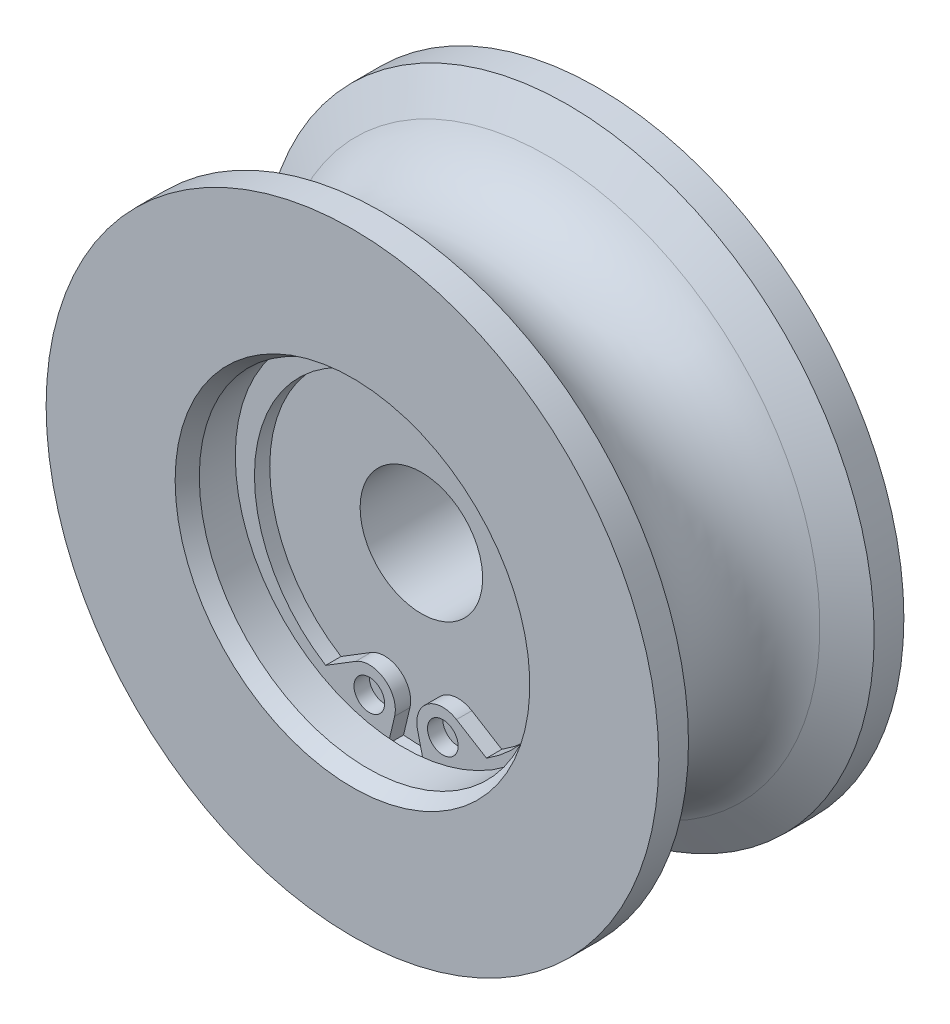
ISO-10303-21;
HEADER;
FILE_DESCRIPTION(('STEP AP214'),'2;1');
FILE_NAME('part.step','',(''),(''),'','','');
FILE_SCHEMA(('AUTOMOTIVE_DESIGN { 1 0 10303 214 1 1 1 1 }'));
ENDSEC;
DATA;
#1=APPLICATION_CONTEXT('core data for automotive mechanical design processes');
#2=APPLICATION_PROTOCOL_DEFINITION('international standard','automotive_design',2000,#1);
#3=PRODUCT_CONTEXT('',#1,'mechanical');
#4=PRODUCT('Part','Part','',(#3));
#5=PRODUCT_RELATED_PRODUCT_CATEGORY('part','',(#4));
#6=PRODUCT_DEFINITION_FORMATION('','',#4);
#7=PRODUCT_DEFINITION_CONTEXT('part definition',#1,'design');
#8=PRODUCT_DEFINITION('design','',#6,#7);
#9=PRODUCT_DEFINITION_SHAPE('','',#8);
#10=(LENGTH_UNIT() NAMED_UNIT(*) SI_UNIT(.MILLI.,.METRE.));
#11=(NAMED_UNIT(*) PLANE_ANGLE_UNIT() SI_UNIT($,.RADIAN.));
#12=(NAMED_UNIT(*) SI_UNIT($,.STERADIAN.) SOLID_ANGLE_UNIT());
#13=UNCERTAINTY_MEASURE_WITH_UNIT(LENGTH_MEASURE(1.E-05),#10,'distance_accuracy_value','');
#14=(GEOMETRIC_REPRESENTATION_CONTEXT(3) GLOBAL_UNCERTAINTY_ASSIGNED_CONTEXT((#13)) GLOBAL_UNIT_ASSIGNED_CONTEXT((#10,
#11,#12)) REPRESENTATION_CONTEXT('',''));
#15=CARTESIAN_POINT('',(0.,0.,0.));
#16=DIRECTION('',(0.,0.,1.));
#17=DIRECTION('',(1.,0.,0.));
#18=AXIS2_PLACEMENT_3D('',#15,#16,#17);
#19=CARTESIAN_POINT('',(0.,4.,3.5));
#20=DIRECTION('',(0.,0.,1.));
#21=DIRECTION('',(1.,0.,0.));
#22=AXIS2_PLACEMENT_3D('',#19,#20,#21);
#23=PLANE('',#22);
#24=CARTESIAN_POINT('',(2.4,-9.28614557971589,3.5));
#25=DIRECTION('',(0.,0.,1.));
#26=DIRECTION('',(1.,0.,0.));
#27=AXIS2_PLACEMENT_3D('',#24,#25,#26);
#28=CIRCLE('',#27,1.);
#29=CARTESIAN_POINT('',(3.4,-9.28614557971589,3.5));
#30=VERTEX_POINT('',#29);
#31=EDGE_CURVE('E571',#30,#30,#28,.T.);
#32=ORIENTED_EDGE('',*,*,#31,.T.);
#33=EDGE_LOOP('',(#32));
#34=FACE_BOUND('',#33,.T.);
#35=ADVANCED_FACE('F14',(#34),#23,.T.);
#36=CARTESIAN_POINT('',(-2.4,-9.28614557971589,3.5));
#37=DIRECTION('',(0.,0.,-1.));
#38=DIRECTION('',(1.,0.,0.));
#39=AXIS2_PLACEMENT_3D('',#36,#37,#38);
#40=CIRCLE('',#39,1.);
#41=CARTESIAN_POINT('',(-1.4,-9.28614557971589,3.5));
#42=VERTEX_POINT('',#41);
#43=EDGE_CURVE('E130',#42,#42,#40,.T.);
#44=ORIENTED_EDGE('',*,*,#43,.F.);
#45=EDGE_LOOP('',(#44));
#46=FACE_BOUND('',#45,.T.);
#47=ADVANCED_FACE('F204',(#46),#23,.T.);
#48=CARTESIAN_POINT('',(0.,0.,0.));
#49=DIRECTION('',(0.,0.,-1.));
#50=DIRECTION('',(-1.,0.,0.));
#51=AXIS2_PLACEMENT_3D('',#48,#49,#50);
#52=TOROIDAL_SURFACE('',#51,20.5,5.5);
#53=CARTESIAN_POINT('',(0.,0.,4.76313972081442));
#54=DIRECTION('',(0.,0.,-1.));
#55=DIRECTION('',(-1.,0.,0.));
#56=AXIS2_PLACEMENT_3D('',#53,#54,#55);
#57=CIRCLE('',#56,17.75);
#58=CARTESIAN_POINT('',(-17.75,0.,4.76313972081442));
#59=VERTEX_POINT('',#58);
#60=EDGE_CURVE('E176',#59,#59,#57,.T.);
#61=ORIENTED_EDGE('',*,*,#60,.T.);
#62=EDGE_LOOP('',(#61));
#63=FACE_BOUND('',#62,.T.);
#64=CARTESIAN_POINT('',(0.,0.,-4.76313972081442));
#65=DIRECTION('',(0.,0.,-1.));
#66=DIRECTION('',(-1.,0.,0.));
#67=AXIS2_PLACEMENT_3D('',#64,#65,#66);
#68=CIRCLE('',#67,17.75);
#69=CARTESIAN_POINT('',(-17.75,0.,-4.76313972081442));
#70=VERTEX_POINT('',#69);
#71=EDGE_CURVE('E179',#70,#70,#68,.T.);
#72=ORIENTED_EDGE('',*,*,#71,.F.);
#73=EDGE_LOOP('',(#72));
#74=FACE_BOUND('',#73,.T.);
#75=ADVANCED_FACE('F199',(#63,#74),#52,.F.);
#76=CARTESIAN_POINT('',(0.,0.,4.76313972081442));
#77=DIRECTION('',(0.,0.,1.));
#78=DIRECTION('',(1.,0.,0.));
#79=AXIS2_PLACEMENT_3D('',#76,#77,#78);
#80=CONICAL_SURFACE('',#79,17.75,1.0471975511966);
#81=CARTESIAN_POINT('',(0.,0.,6.06217782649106));
#82=DIRECTION('',(0.,0.,-1.));
#83=DIRECTION('',(-1.,0.,0.));
#84=AXIS2_PLACEMENT_3D('',#81,#82,#83);
#85=CIRCLE('',#84,20.);
#86=CARTESIAN_POINT('',(-20.,0.,6.06217782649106));
#87=VERTEX_POINT('',#86);
#88=EDGE_CURVE('E173',#87,#87,#85,.T.);
#89=ORIENTED_EDGE('',*,*,#88,.T.);
#90=EDGE_LOOP('',(#89));
#91=FACE_BOUND('',#90,.T.);
#92=ORIENTED_EDGE('',*,*,#60,.F.);
#93=EDGE_LOOP('',(#92));
#94=FACE_BOUND('',#93,.T.);
#95=ADVANCED_FACE('F190',(#91,#94),#80,.T.);
#96=CARTESIAN_POINT('',(0.,0.,-6.06217782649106));
#97=DIRECTION('',(0.,0.,-1.));
#98=DIRECTION('',(-1.,0.,0.));
#99=AXIS2_PLACEMENT_3D('',#96,#97,#98);
#100=CONICAL_SURFACE('',#99,20.,1.0471975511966);
#101=ORIENTED_EDGE('',*,*,#71,.T.);
#102=EDGE_LOOP('',(#101));
#103=FACE_BOUND('',#102,.T.);
#104=CARTESIAN_POINT('',(0.,0.,-6.06217782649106));
#105=DIRECTION('',(0.,0.,-1.));
#106=DIRECTION('',(-1.,0.,0.));
#107=AXIS2_PLACEMENT_3D('',#104,#105,#106);
#108=CIRCLE('',#107,20.);
#109=CARTESIAN_POINT('',(-20.,0.,-6.06217782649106));
#110=VERTEX_POINT('',#109);
#111=EDGE_CURVE('E131',#110,#110,#108,.T.);
#112=ORIENTED_EDGE('',*,*,#111,.F.);
#113=EDGE_LOOP('',(#112));
#114=FACE_BOUND('',#113,.T.);
#115=ADVANCED_FACE('F187',(#103,#114),#100,.T.);
#116=CARTESIAN_POINT('',(0.,0.,-8.));
#117=DIRECTION('',(0.,0.,-1.));
#118=DIRECTION('',(-1.,0.,0.));
#119=AXIS2_PLACEMENT_3D('',#116,#117,#118);
#120=CYLINDRICAL_SURFACE('',#119,20.);
#121=CARTESIAN_POINT('',(0.,0.,8.));
#122=DIRECTION('',(0.,0.,-1.));
#123=DIRECTION('',(-1.,0.,0.));
#124=AXIS2_PLACEMENT_3D('',#121,#122,#123);
#125=CIRCLE('',#124,20.);
#126=CARTESIAN_POINT('',(-20.,0.,8.));
#127=VERTEX_POINT('',#126);
#128=EDGE_CURVE('E170',#127,#127,#125,.T.);
#129=ORIENTED_EDGE('',*,*,#128,.T.);
#130=EDGE_LOOP('',(#129));
#131=FACE_BOUND('',#130,.T.);
#132=ORIENTED_EDGE('',*,*,#88,.F.);
#133=EDGE_LOOP('',(#132));
#134=FACE_BOUND('',#133,.T.);
#135=ADVANCED_FACE('F189',(#131,#134),#120,.T.);
#136=CARTESIAN_POINT('',(0.,0.,-8.));
#137=DIRECTION('',(0.,0.,-1.));
#138=DIRECTION('',(-1.,0.,0.));
#139=AXIS2_PLACEMENT_3D('',#136,#137,#138);
#140=CYLINDRICAL_SURFACE('',#139,20.);
#141=ORIENTED_EDGE('',*,*,#111,.T.);
#142=EDGE_LOOP('',(#141));
#143=FACE_BOUND('',#142,.T.);
#144=CARTESIAN_POINT('',(0.,0.,-8.));
#145=DIRECTION('',(0.,0.,-1.));
#146=DIRECTION('',(-1.,0.,0.));
#147=AXIS2_PLACEMENT_3D('',#144,#145,#146);
#148=CIRCLE('',#147,20.);
#149=CARTESIAN_POINT('',(-20.,0.,-8.));
#150=VERTEX_POINT('',#149);
#151=EDGE_CURVE('E142',#150,#150,#148,.T.);
#152=ORIENTED_EDGE('',*,*,#151,.F.);
#153=EDGE_LOOP('',(#152));
#154=FACE_BOUND('',#153,.T.);
#155=ADVANCED_FACE('F16',(#143,#154),#140,.T.);
#156=CARTESIAN_POINT('',(0.,20.,8.));
#157=DIRECTION('',(0.,0.,1.));
#158=DIRECTION('',(1.,0.,0.));
#159=AXIS2_PLACEMENT_3D('',#156,#157,#158);
#160=PLANE('',#159);
#161=CARTESIAN_POINT('',(0.,0.,8.));
#162=DIRECTION('',(0.,0.,-1.));
#163=DIRECTION('',(-1.,0.,0.));
#164=AXIS2_PLACEMENT_3D('',#161,#162,#163);
#165=CIRCLE('',#164,11.5773502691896);
#166=CARTESIAN_POINT('',(-11.5773502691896,0.,8.));
#167=VERTEX_POINT('',#166);
#168=EDGE_CURVE('E167',#167,#167,#165,.T.);
#169=ORIENTED_EDGE('',*,*,#168,.T.);
#170=EDGE_LOOP('',(#169));
#171=FACE_BOUND('',#170,.T.);
#172=ORIENTED_EDGE('',*,*,#128,.F.);
#173=EDGE_LOOP('',(#172));
#174=FACE_BOUND('',#173,.T.);
#175=ADVANCED_FACE('F260',(#171,#174),#160,.T.);
#176=CARTESIAN_POINT('',(0.,9.,-8.));
#177=DIRECTION('',(0.,0.,-1.));
#178=DIRECTION('',(-1.,0.,0.));
#179=AXIS2_PLACEMENT_3D('',#176,#177,#178);
#180=PLANE('',#179);
#181=ORIENTED_EDGE('',*,*,#151,.T.);
#182=EDGE_LOOP('',(#181));
#183=FACE_BOUND('',#182,.T.);
#184=CARTESIAN_POINT('',(0.,0.,-8.));
#185=DIRECTION('',(0.,0.,-1.));
#186=DIRECTION('',(-1.,0.,0.));
#187=AXIS2_PLACEMENT_3D('',#184,#185,#186);
#188=CIRCLE('',#187,9.);
#189=CARTESIAN_POINT('',(-9.,0.,-8.));
#190=VERTEX_POINT('',#189);
#191=EDGE_CURVE('E145',#190,#190,#188,.T.);
#192=ORIENTED_EDGE('',*,*,#191,.F.);
#193=EDGE_LOOP('',(#192));
#194=FACE_BOUND('',#193,.T.);
#195=ADVANCED_FACE('F256',(#183,#194),#180,.T.);
#196=CARTESIAN_POINT('',(0.,0.,8.));
#197=DIRECTION('',(0.,0.,1.));
#198=DIRECTION('',(1.,0.,0.));
#199=AXIS2_PLACEMENT_3D('',#196,#197,#198);
#200=CONICAL_SURFACE('',#199,11.5773502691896,0.523598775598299);
#201=CARTESIAN_POINT('',(0.,0.,7.));
#202=DIRECTION('',(0.,0.,-1.));
#203=DIRECTION('',(-1.,0.,0.));
#204=AXIS2_PLACEMENT_3D('',#201,#202,#203);
#205=CIRCLE('',#204,11.);
#206=CARTESIAN_POINT('',(-11.,0.,7.));
#207=VERTEX_POINT('',#206);
#208=EDGE_CURVE('E164',#207,#207,#205,.T.);
#209=ORIENTED_EDGE('',*,*,#208,.T.);
#210=EDGE_LOOP('',(#209));
#211=FACE_BOUND('',#210,.T.);
#212=ORIENTED_EDGE('',*,*,#168,.F.);
#213=EDGE_LOOP('',(#212));
#214=FACE_BOUND('',#213,.T.);
#215=ADVANCED_FACE('F259',(#211,#214),#200,.F.);
#216=CARTESIAN_POINT('',(0.,0.,-8.));
#217=DIRECTION('',(0.,0.,-1.));
#218=DIRECTION('',(-1.,0.,0.));
#219=AXIS2_PLACEMENT_3D('',#216,#217,#218);
#220=CYLINDRICAL_SURFACE('',#219,9.);
#221=ORIENTED_EDGE('',*,*,#191,.T.);
#222=EDGE_LOOP('',(#221));
#223=FACE_BOUND('',#222,.T.);
#224=CARTESIAN_POINT('',(0.,0.,-3.5));
#225=DIRECTION('',(0.,0.,-1.));
#226=DIRECTION('',(-1.,0.,0.));
#227=AXIS2_PLACEMENT_3D('',#224,#225,#226);
#228=CIRCLE('',#227,9.);
#229=CARTESIAN_POINT('',(-9.,0.,-3.5));
#230=VERTEX_POINT('',#229);
#231=EDGE_CURVE('E148',#230,#230,#228,.T.);
#232=ORIENTED_EDGE('',*,*,#231,.F.);
#233=EDGE_LOOP('',(#232));
#234=FACE_BOUND('',#233,.T.);
#235=ADVANCED_FACE('F262',(#223,#234),#220,.F.);
#236=CARTESIAN_POINT('',(0.,0.,-8.));
#237=DIRECTION('',(0.,0.,-1.));
#238=DIRECTION('',(-1.,0.,0.));
#239=AXIS2_PLACEMENT_3D('',#236,#237,#238);
#240=CYLINDRICAL_SURFACE('',#239,11.);
#241=CARTESIAN_POINT('',(0.,0.,4.65));
#242=DIRECTION('',(0.,0.,-1.));
#243=DIRECTION('',(-1.,0.,0.));
#244=AXIS2_PLACEMENT_3D('',#241,#242,#243);
#245=CIRCLE('',#244,11.);
#246=CARTESIAN_POINT('',(-11.,0.,4.65));
#247=VERTEX_POINT('',#246);
#248=EDGE_CURVE('E161',#247,#247,#245,.T.);
#249=ORIENTED_EDGE('',*,*,#248,.T.);
#250=EDGE_LOOP('',(#249));
#251=FACE_BOUND('',#250,.T.);
#252=ORIENTED_EDGE('',*,*,#208,.F.);
#253=EDGE_LOOP('',(#252));
#254=FACE_BOUND('',#253,.T.);
#255=ADVANCED_FACE('F265',(#251,#254),#240,.F.);
#256=CARTESIAN_POINT('',(0.,9.,-3.5));
#257=DIRECTION('',(0.,0.,-1.));
#258=DIRECTION('',(-1.,0.,0.));
#259=AXIS2_PLACEMENT_3D('',#256,#257,#258);
#260=PLANE('',#259);
#261=ORIENTED_EDGE('',*,*,#231,.T.);
#262=EDGE_LOOP('',(#261));
#263=FACE_BOUND('',#262,.T.);
#264=CARTESIAN_POINT('',(0.,0.,-3.5));
#265=DIRECTION('',(0.,0.,-1.));
#266=DIRECTION('',(-1.,0.,0.));
#267=AXIS2_PLACEMENT_3D('',#264,#265,#266);
#268=CIRCLE('',#267,4.);
#269=CARTESIAN_POINT('',(-4.,0.,-3.5));
#270=VERTEX_POINT('',#269);
#271=EDGE_CURVE('E151',#270,#270,#268,.T.);
#272=ORIENTED_EDGE('',*,*,#271,.F.);
#273=EDGE_LOOP('',(#272));
#274=FACE_BOUND('',#273,.T.);
#275=ADVANCED_FACE('F267',(#263,#274),#260,.T.);
#276=CARTESIAN_POINT('',(0.,11.5,4.65));
#277=DIRECTION('',(0.,0.,-1.));
#278=DIRECTION('',(-1.,0.,0.));
#279=AXIS2_PLACEMENT_3D('',#276,#277,#278);
#280=PLANE('',#279);
#281=CARTESIAN_POINT('',(0.,0.,4.65));
#282=DIRECTION('',(0.,0.,-1.));
#283=DIRECTION('',(-1.,0.,0.));
#284=AXIS2_PLACEMENT_3D('',#281,#282,#283);
#285=CIRCLE('',#284,11.5);
#286=CARTESIAN_POINT('',(-11.5,0.,4.65));
#287=VERTEX_POINT('',#286);
#288=EDGE_CURVE('E158',#287,#287,#285,.T.);
#289=ORIENTED_EDGE('',*,*,#288,.T.);
#290=EDGE_LOOP('',(#289));
#291=FACE_BOUND('',#290,.T.);
#292=ORIENTED_EDGE('',*,*,#248,.F.);
#293=EDGE_LOOP('',(#292));
#294=FACE_BOUND('',#293,.T.);
#295=ADVANCED_FACE('F269',(#291,#294),#280,.T.);
#296=CARTESIAN_POINT('',(0.,0.,-8.));
#297=DIRECTION('',(0.,0.,-1.));
#298=DIRECTION('',(-1.,0.,0.));
#299=AXIS2_PLACEMENT_3D('',#296,#297,#298);
#300=CYLINDRICAL_SURFACE('',#299,11.5);
#301=ORIENTED_EDGE('',*,*,#288,.F.);
#302=EDGE_LOOP('',(#301));
#303=FACE_BOUND('',#302,.T.);
#304=DIRECTION('',(0.,0.,-1.));
#305=VECTOR('',#304,1.);
#306=CARTESIAN_POINT('',(1.16498191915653,-11.440839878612,-8.));
#307=LINE('',#306,#305);
#308=CARTESIAN_POINT('',(1.16498191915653,-11.440839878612,3.5));
#309=VERTEX_POINT('',#308);
#310=CARTESIAN_POINT('',(1.16498191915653,-11.440839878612,4.5));
#311=VERTEX_POINT('',#310);
#312=EDGE_CURVE('E18',#309,#311,#307,.F.);
#313=ORIENTED_EDGE('',*,*,#312,.F.);
#314=CARTESIAN_POINT('',(0.,0.,3.5));
#315=DIRECTION('',(0.,0.,-1.));
#316=DIRECTION('',(-1.,0.,0.));
#317=AXIS2_PLACEMENT_3D('',#314,#315,#316);
#318=CIRCLE('',#317,11.5);
#319=CARTESIAN_POINT('',(-1.16498191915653,-11.440839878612,3.5));
#320=VERTEX_POINT('',#319);
#321=EDGE_CURVE('E107',#309,#320,#318,.T.);
#322=ORIENTED_EDGE('',*,*,#321,.T.);
#323=DIRECTION('',(0.,0.,-1.));
#324=VECTOR('',#323,1.);
#325=CARTESIAN_POINT('',(-1.16498191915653,-11.440839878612,-8.));
#326=LINE('',#325,#324);
#327=CARTESIAN_POINT('',(-1.16498191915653,-11.440839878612,4.5));
#328=VERTEX_POINT('',#327);
#329=EDGE_CURVE('E138',#328,#320,#326,.T.);
#330=ORIENTED_EDGE('',*,*,#329,.F.);
#331=CARTESIAN_POINT('',(0.,0.,4.5));
#332=DIRECTION('',(0.,0.,-1.));
#333=DIRECTION('',(-1.,0.,0.));
#334=AXIS2_PLACEMENT_3D('',#331,#332,#333);
#335=CIRCLE('',#334,11.5);
#336=EDGE_CURVE('E9',#311,#328,#335,.F.);
#337=ORIENTED_EDGE('',*,*,#336,.F.);
#338=EDGE_LOOP('',(#313,#322,#330,#337));
#339=FACE_BOUND('',#338,.T.);
#340=ADVANCED_FACE('F272',(#303,#339),#300,.F.);
#341=CARTESIAN_POINT('',(0.,0.,-8.));
#342=DIRECTION('',(0.,0.,-1.));
#343=DIRECTION('',(-1.,0.,0.));
#344=AXIS2_PLACEMENT_3D('',#341,#342,#343);
#345=CYLINDRICAL_SURFACE('',#344,4.);
#346=ORIENTED_EDGE('',*,*,#271,.T.);
#347=EDGE_LOOP('',(#346));
#348=FACE_BOUND('',#347,.T.);
#349=CARTESIAN_POINT('',(0.,0.,3.5));
#350=DIRECTION('',(0.,0.,-1.));
#351=DIRECTION('',(-1.,0.,0.));
#352=AXIS2_PLACEMENT_3D('',#349,#350,#351);
#353=CIRCLE('',#352,4.);
#354=CARTESIAN_POINT('',(-4.,0.,3.5));
#355=VERTEX_POINT('',#354);
#356=EDGE_CURVE('E154',#355,#355,#353,.T.);
#357=ORIENTED_EDGE('',*,*,#356,.F.);
#358=EDGE_LOOP('',(#357));
#359=FACE_BOUND('',#358,.T.);
#360=ADVANCED_FACE('F216',(#348,#359),#345,.F.);
#361=ORIENTED_EDGE('',*,*,#356,.T.);
#362=EDGE_LOOP('',(#361));
#363=FACE_BOUND('',#362,.T.);
#364=DIRECTION('',(0.231349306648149,-0.972870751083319,0.));
#365=VECTOR('',#364,1.);
#366=CARTESIAN_POINT('',(0.746119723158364,-9.67943940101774,3.5));
#367=LINE('',#366,#365);
#368=CARTESIAN_POINT('',(0.746119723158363,-9.67943940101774,3.5));
#369=VERTEX_POINT('',#368);
#370=EDGE_CURVE('E34',#369,#309,#367,.T.);
#371=ORIENTED_EDGE('',*,*,#370,.F.);
#372=CARTESIAN_POINT('',(2.4,-9.28614557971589,3.5));
#373=DIRECTION('',(0.,0.,1.));
#374=DIRECTION('',(1.,0.,0.));
#375=AXIS2_PLACEMENT_3D('',#372,#373,#374);
#376=CIRCLE('',#375,1.7);
#377=CARTESIAN_POINT('',(3.29136923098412,-7.83857489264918,3.5));
#378=VERTEX_POINT('',#377);
#379=EDGE_CURVE('E94',#378,#369,#376,.T.);
#380=ORIENTED_EDGE('',*,*,#379,.F.);
#381=DIRECTION('',(-0.851512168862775,0.524334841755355,0.));
#382=VECTOR('',#381,1.);
#383=CARTESIAN_POINT('',(3.29136923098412,-7.83857489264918,3.5));
#384=LINE('',#383,#382);
#385=CARTESIAN_POINT('',(5.2489218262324,-9.04397520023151,3.5));
#386=VERTEX_POINT('',#385);
#387=EDGE_CURVE('E136',#386,#378,#384,.T.);
#388=ORIENTED_EDGE('',*,*,#387,.F.);
#389=CARTESIAN_POINT('',(0.,-0.65,3.5));
#390=DIRECTION('',(0.,0.,-1.));
#391=DIRECTION('',(0.,-1.,0.));
#392=AXIS2_PLACEMENT_3D('',#389,#390,#391);
#393=CIRCLE('',#392,9.9);
#394=CARTESIAN_POINT('',(-5.24892182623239,-9.04397520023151,3.5));
#395=VERTEX_POINT('',#394);
#396=EDGE_CURVE('E575',#395,#386,#393,.T.);
#397=ORIENTED_EDGE('',*,*,#396,.F.);
#398=DIRECTION('',(-0.851512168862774,-0.524334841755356,0.));
#399=VECTOR('',#398,1.);
#400=CARTESIAN_POINT('',(-3.29136923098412,-7.83857489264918,3.5));
#401=LINE('',#400,#399);
#402=CARTESIAN_POINT('',(-3.29136923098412,-7.83857489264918,3.5));
#403=VERTEX_POINT('',#402);
#404=EDGE_CURVE('E141',#403,#395,#401,.T.);
#405=ORIENTED_EDGE('',*,*,#404,.F.);
#406=CARTESIAN_POINT('',(-2.4,-9.28614557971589,3.5));
#407=DIRECTION('',(0.,0.,1.));
#408=DIRECTION('',(-1.,0.,0.));
#409=AXIS2_PLACEMENT_3D('',#406,#407,#408);
#410=CIRCLE('',#409,1.7);
#411=CARTESIAN_POINT('',(-0.746119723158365,-9.67943940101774,3.5));
#412=VERTEX_POINT('',#411);
#413=EDGE_CURVE('E121',#412,#403,#410,.T.);
#414=ORIENTED_EDGE('',*,*,#413,.F.);
#415=DIRECTION('',(0.231349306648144,0.97287075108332,0.));
#416=VECTOR('',#415,1.);
#417=CARTESIAN_POINT('',(-0.746119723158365,-9.67943940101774,3.5));
#418=LINE('',#417,#416);
#419=EDGE_CURVE('E115',#320,#412,#418,.T.);
#420=ORIENTED_EDGE('',*,*,#419,.F.);
#421=ORIENTED_EDGE('',*,*,#321,.F.);
#422=EDGE_LOOP('',(#371,#380,#388,#397,#405,#414,#420,#421));
#423=FACE_BOUND('',#422,.T.);
#424=ADVANCED_FACE('F105',(#363,#423),#23,.T.);
#425=CARTESIAN_POINT('',(0.,-0.65,4.5));
#426=DIRECTION('',(0.,0.,1.));
#427=DIRECTION('',(-1.,0.,0.));
#428=AXIS2_PLACEMENT_3D('',#425,#426,#427);
#429=CYLINDRICAL_SURFACE('',#428,9.9);
#430=ORIENTED_EDGE('',*,*,#396,.T.);
#431=DIRECTION('',(0.,0.,-1.));
#432=VECTOR('',#431,1.);
#433=CARTESIAN_POINT('',(5.2489218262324,-9.04397520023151,4.5));
#434=LINE('',#433,#432);
#435=CARTESIAN_POINT('',(5.2489218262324,-9.04397520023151,4.5));
#436=VERTEX_POINT('',#435);
#437=EDGE_CURVE('E132',#436,#386,#434,.T.);
#438=ORIENTED_EDGE('',*,*,#437,.F.);
#439=CARTESIAN_POINT('',(0.,-0.65,4.5));
#440=DIRECTION('',(0.,0.,-1.));
#441=DIRECTION('',(0.,-1.,0.));
#442=AXIS2_PLACEMENT_3D('',#439,#440,#441);
#443=CIRCLE('',#442,9.9);
#444=CARTESIAN_POINT('',(-5.24892182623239,-9.04397520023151,4.5));
#445=VERTEX_POINT('',#444);
#446=EDGE_CURVE('E549',#445,#436,#443,.T.);
#447=ORIENTED_EDGE('',*,*,#446,.F.);
#448=DIRECTION('',(0.,0.,-1.));
#449=VECTOR('',#448,1.);
#450=CARTESIAN_POINT('',(-5.24892182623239,-9.04397520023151,4.5));
#451=LINE('',#450,#449);
#452=EDGE_CURVE('E125',#445,#395,#451,.T.);
#453=ORIENTED_EDGE('',*,*,#452,.T.);
#454=EDGE_LOOP('',(#430,#438,#447,#453));
#455=FACE_BOUND('',#454,.T.);
#456=ADVANCED_FACE('F207',(#455),#429,.F.);
#457=CARTESIAN_POINT('',(3.29136923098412,-7.83857489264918,4.5));
#458=DIRECTION('',(-0.524334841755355,-0.851512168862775,0.));
#459=DIRECTION('',(-0.851512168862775,0.524334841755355,0.));
#460=AXIS2_PLACEMENT_3D('',#457,#458,#459);
#461=PLANE('',#460);
#462=ORIENTED_EDGE('',*,*,#387,.T.);
#463=DIRECTION('',(0.,0.,-1.));
#464=VECTOR('',#463,1.);
#465=CARTESIAN_POINT('',(3.29136923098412,-7.83857489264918,4.5));
#466=LINE('',#465,#464);
#467=CARTESIAN_POINT('',(3.29136923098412,-7.83857489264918,4.5));
#468=VERTEX_POINT('',#467);
#469=EDGE_CURVE('E98',#468,#378,#466,.T.);
#470=ORIENTED_EDGE('',*,*,#469,.F.);
#471=DIRECTION('',(-0.851512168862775,0.524334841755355,0.));
#472=VECTOR('',#471,1.);
#473=CARTESIAN_POINT('',(3.29136923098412,-7.83857489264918,4.5));
#474=LINE('',#473,#472);
#475=EDGE_CURVE('E552',#436,#468,#474,.T.);
#476=ORIENTED_EDGE('',*,*,#475,.F.);
#477=ORIENTED_EDGE('',*,*,#437,.T.);
#478=EDGE_LOOP('',(#462,#470,#476,#477));
#479=FACE_BOUND('',#478,.T.);
#480=ADVANCED_FACE('F219',(#479),#461,.F.);
#481=CARTESIAN_POINT('',(2.4,-9.28614557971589,4.5));
#482=DIRECTION('',(0.,0.,1.));
#483=DIRECTION('',(-1.,0.,0.));
#484=AXIS2_PLACEMENT_3D('',#481,#482,#483);
#485=CYLINDRICAL_SURFACE('',#484,1.7);
#486=ORIENTED_EDGE('',*,*,#379,.T.);
#487=DIRECTION('',(0.,0.,-1.));
#488=VECTOR('',#487,1.);
#489=CARTESIAN_POINT('',(0.746119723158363,-9.67943940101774,4.5));
#490=LINE('',#489,#488);
#491=CARTESIAN_POINT('',(0.746119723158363,-9.67943940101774,4.5));
#492=VERTEX_POINT('',#491);
#493=EDGE_CURVE('E97',#492,#369,#490,.T.);
#494=ORIENTED_EDGE('',*,*,#493,.F.);
#495=CARTESIAN_POINT('',(2.4,-9.28614557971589,4.5));
#496=DIRECTION('',(0.,0.,1.));
#497=DIRECTION('',(1.,0.,0.));
#498=AXIS2_PLACEMENT_3D('',#495,#496,#497);
#499=CIRCLE('',#498,1.7);
#500=EDGE_CURVE('E537',#468,#492,#499,.T.);
#501=ORIENTED_EDGE('',*,*,#500,.F.);
#502=ORIENTED_EDGE('',*,*,#469,.T.);
#503=EDGE_LOOP('',(#486,#494,#501,#502));
#504=FACE_BOUND('',#503,.T.);
#505=ADVANCED_FACE('F95',(#504),#485,.T.);
#506=CARTESIAN_POINT('',(-0.746119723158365,-9.67943940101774,4.5));
#507=DIRECTION('',(-0.97287075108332,0.231349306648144,0.));
#508=DIRECTION('',(0.,0.,1.));
#509=AXIS2_PLACEMENT_3D('',#506,#507,#508);
#510=PLANE('',#509);
#511=DIRECTION('',(0.231349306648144,0.97287075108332,0.));
#512=VECTOR('',#511,1.);
#513=CARTESIAN_POINT('',(-0.746119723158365,-9.67943940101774,4.5));
#514=LINE('',#513,#512);
#515=CARTESIAN_POINT('',(-0.746119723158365,-9.67943940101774,4.5));
#516=VERTEX_POINT('',#515);
#517=EDGE_CURVE('E480',#328,#516,#514,.T.);
#518=ORIENTED_EDGE('',*,*,#517,.F.);
#519=ORIENTED_EDGE('',*,*,#329,.T.);
#520=ORIENTED_EDGE('',*,*,#419,.T.);
#521=DIRECTION('',(0.,0.,-1.));
#522=VECTOR('',#521,1.);
#523=CARTESIAN_POINT('',(-0.746119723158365,-9.67943940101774,4.5));
#524=LINE('',#523,#522);
#525=EDGE_CURVE('E556',#516,#412,#524,.T.);
#526=ORIENTED_EDGE('',*,*,#525,.F.);
#527=EDGE_LOOP('',(#518,#519,#520,#526));
#528=FACE_BOUND('',#527,.T.);
#529=ADVANCED_FACE('F244',(#528),#510,.F.);
#530=CARTESIAN_POINT('',(0.,-0.65,4.5));
#531=DIRECTION('',(0.,0.,-1.));
#532=DIRECTION('',(0.,-1.,0.));
#533=AXIS2_PLACEMENT_3D('',#530,#531,#532);
#534=PLANE('',#533);
#535=CARTESIAN_POINT('',(-2.4,-9.28614557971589,4.5));
#536=DIRECTION('',(0.,0.,-1.));
#537=DIRECTION('',(1.,0.,0.));
#538=AXIS2_PLACEMENT_3D('',#535,#536,#537);
#539=CIRCLE('',#538,1.);
#540=CARTESIAN_POINT('',(-1.4,-9.28614557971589,4.5));
#541=VERTEX_POINT('',#540);
#542=EDGE_CURVE('E102',#541,#541,#539,.T.);
#543=ORIENTED_EDGE('',*,*,#542,.T.);
#544=EDGE_LOOP('',(#543));
#545=FACE_BOUND('',#544,.T.);
#546=CARTESIAN_POINT('',(2.4,-9.28614557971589,4.5));
#547=DIRECTION('',(0.,0.,1.));
#548=DIRECTION('',(1.,0.,0.));
#549=AXIS2_PLACEMENT_3D('',#546,#547,#548);
#550=CIRCLE('',#549,1.);
#551=CARTESIAN_POINT('',(3.4,-9.28614557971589,4.5));
#552=VERTEX_POINT('',#551);
#553=EDGE_CURVE('E127',#552,#552,#550,.T.);
#554=ORIENTED_EDGE('',*,*,#553,.F.);
#555=EDGE_LOOP('',(#554));
#556=FACE_BOUND('',#555,.T.);
#557=DIRECTION('',(0.231349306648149,-0.972870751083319,0.));
#558=VECTOR('',#557,1.);
#559=CARTESIAN_POINT('',(0.746119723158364,-9.67943940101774,4.5));
#560=LINE('',#559,#558);
#561=EDGE_CURVE('E112',#492,#311,#560,.T.);
#562=ORIENTED_EDGE('',*,*,#561,.T.);
#563=ORIENTED_EDGE('',*,*,#336,.T.);
#564=ORIENTED_EDGE('',*,*,#517,.T.);
#565=CARTESIAN_POINT('',(-2.4,-9.28614557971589,4.5));
#566=DIRECTION('',(0.,0.,1.));
#567=DIRECTION('',(-1.,0.,0.));
#568=AXIS2_PLACEMENT_3D('',#565,#566,#567);
#569=CIRCLE('',#568,1.7);
#570=CARTESIAN_POINT('',(-3.29136923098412,-7.83857489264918,4.5));
#571=VERTEX_POINT('',#570);
#572=EDGE_CURVE('E482',#516,#571,#569,.T.);
#573=ORIENTED_EDGE('',*,*,#572,.T.);
#574=DIRECTION('',(-0.851512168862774,-0.524334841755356,0.));
#575=VECTOR('',#574,1.);
#576=CARTESIAN_POINT('',(-3.29136923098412,-7.83857489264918,4.5));
#577=LINE('',#576,#575);
#578=EDGE_CURVE('E137',#571,#445,#577,.T.);
#579=ORIENTED_EDGE('',*,*,#578,.T.);
#580=ORIENTED_EDGE('',*,*,#446,.T.);
#581=ORIENTED_EDGE('',*,*,#475,.T.);
#582=ORIENTED_EDGE('',*,*,#500,.T.);
#583=EDGE_LOOP('',(#562,#563,#564,#573,#579,#580,#581,#582));
#584=FACE_BOUND('',#583,.T.);
#585=ADVANCED_FACE('F236',(#545,#556,#584),#534,.F.);
#586=CARTESIAN_POINT('',(2.4,-9.28614557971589,4.5));
#587=DIRECTION('',(0.,0.,1.));
#588=DIRECTION('',(-1.,0.,0.));
#589=AXIS2_PLACEMENT_3D('',#586,#587,#588);
#590=CYLINDRICAL_SURFACE('',#589,1.);
#591=ORIENTED_EDGE('',*,*,#31,.F.);
#592=EDGE_LOOP('',(#591));
#593=FACE_BOUND('',#592,.T.);
#594=ORIENTED_EDGE('',*,*,#553,.T.);
#595=EDGE_LOOP('',(#594));
#596=FACE_BOUND('',#595,.T.);
#597=ADVANCED_FACE('F232',(#593,#596),#590,.F.);
#598=CARTESIAN_POINT('',(-2.4,-9.28614557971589,4.5));
#599=DIRECTION('',(0.,0.,1.));
#600=DIRECTION('',(-1.,0.,0.));
#601=AXIS2_PLACEMENT_3D('',#598,#599,#600);
#602=CYLINDRICAL_SURFACE('',#601,1.);
#603=ORIENTED_EDGE('',*,*,#43,.T.);
#604=EDGE_LOOP('',(#603));
#605=FACE_BOUND('',#604,.T.);
#606=ORIENTED_EDGE('',*,*,#542,.F.);
#607=EDGE_LOOP('',(#606));
#608=FACE_BOUND('',#607,.T.);
#609=ADVANCED_FACE('F228',(#605,#608),#602,.F.);
#610=CARTESIAN_POINT('',(-3.29136923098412,-7.83857489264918,4.5));
#611=DIRECTION('',(0.524334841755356,-0.851512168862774,0.));
#612=DIRECTION('',(0.,0.,-1.));
#613=AXIS2_PLACEMENT_3D('',#610,#611,#612);
#614=PLANE('',#613);
#615=ORIENTED_EDGE('',*,*,#404,.T.);
#616=ORIENTED_EDGE('',*,*,#452,.F.);
#617=ORIENTED_EDGE('',*,*,#578,.F.);
#618=DIRECTION('',(0.,0.,-1.));
#619=VECTOR('',#618,1.);
#620=CARTESIAN_POINT('',(-3.29136923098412,-7.83857489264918,4.5));
#621=LINE('',#620,#619);
#622=EDGE_CURVE('E564',#571,#403,#621,.T.);
#623=ORIENTED_EDGE('',*,*,#622,.T.);
#624=EDGE_LOOP('',(#615,#616,#617,#623));
#625=FACE_BOUND('',#624,.T.);
#626=ADVANCED_FACE('F231',(#625),#614,.F.);
#627=CARTESIAN_POINT('',(-2.4,-9.28614557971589,4.5));
#628=DIRECTION('',(0.,0.,1.));
#629=DIRECTION('',(-1.,0.,0.));
#630=AXIS2_PLACEMENT_3D('',#627,#628,#629);
#631=CYLINDRICAL_SURFACE('',#630,1.7);
#632=ORIENTED_EDGE('',*,*,#413,.T.);
#633=ORIENTED_EDGE('',*,*,#622,.F.);
#634=ORIENTED_EDGE('',*,*,#572,.F.);
#635=ORIENTED_EDGE('',*,*,#525,.T.);
#636=EDGE_LOOP('',(#632,#633,#634,#635));
#637=FACE_BOUND('',#636,.T.);
#638=ADVANCED_FACE('F238',(#637),#631,.T.);
#639=CARTESIAN_POINT('',(0.746119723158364,-9.67943940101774,4.5));
#640=DIRECTION('',(0.972870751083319,0.231349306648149,0.));
#641=DIRECTION('',(0.,0.,-1.));
#642=AXIS2_PLACEMENT_3D('',#639,#640,#641);
#643=PLANE('',#642);
#644=ORIENTED_EDGE('',*,*,#370,.T.);
#645=ORIENTED_EDGE('',*,*,#312,.T.);
#646=ORIENTED_EDGE('',*,*,#561,.F.);
#647=ORIENTED_EDGE('',*,*,#493,.T.);
#648=EDGE_LOOP('',(#644,#645,#646,#647));
#649=FACE_BOUND('',#648,.T.);
#650=ADVANCED_FACE('F110',(#649),#643,.F.);
#651=CLOSED_SHELL('',(#35,#47,#75,#95,#115,#135,#155,#175,#195,#215,#235,#255,#275,#295,#340,
#360,#424,#456,#480,#505,#529,#585,#597,#609,#626,#638,#650));
#652=MANIFOLD_SOLID_BREP('B1',#651);
#653=ADVANCED_BREP_SHAPE_REPRESENTATION('',(#18,#652),#14);
#654=SHAPE_DEFINITION_REPRESENTATION(#9,#653);
ENDSEC;
END-ISO-10303-21;
